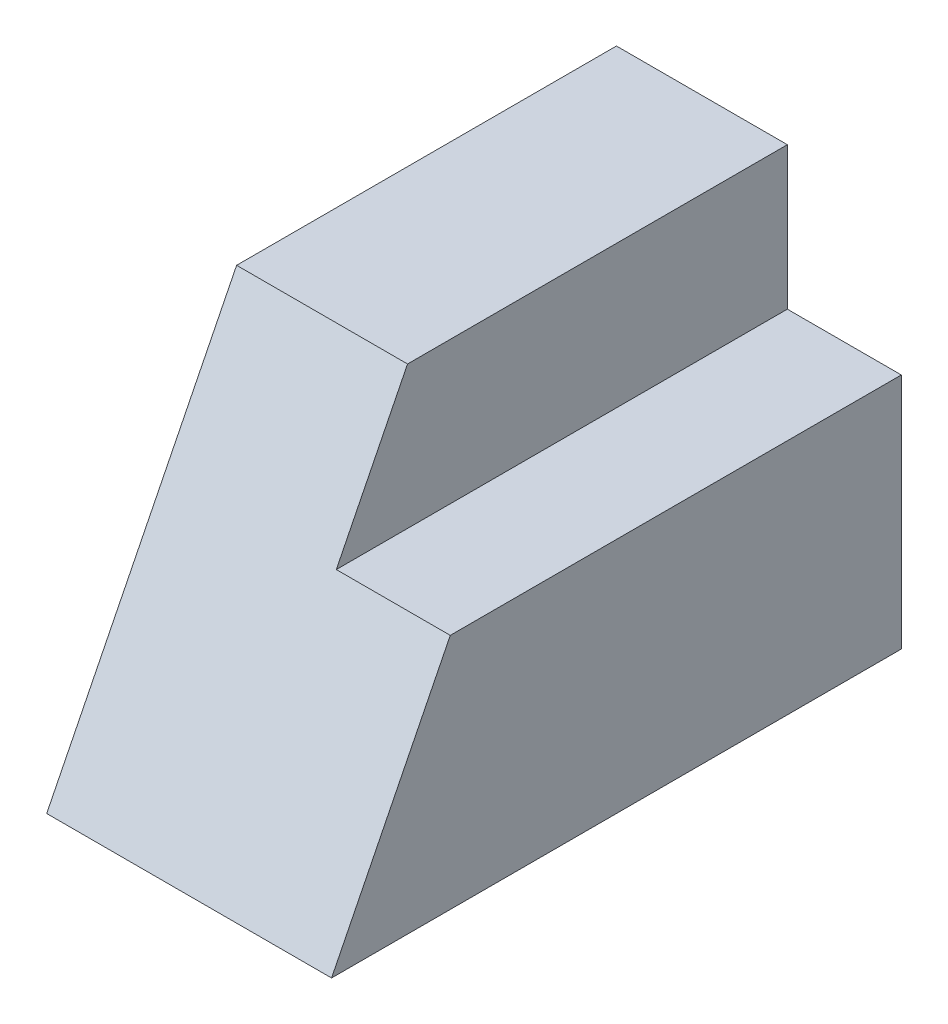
ISO-10303-21;
HEADER;
FILE_DESCRIPTION(('STEP AP214'),'2;1');
FILE_NAME('part.step','',(''),(''),'','','');
FILE_SCHEMA(('AUTOMOTIVE_DESIGN { 1 0 10303 214 1 1 1 1 }'));
ENDSEC;
DATA;
#1=APPLICATION_CONTEXT('core data for automotive mechanical design processes');
#2=APPLICATION_PROTOCOL_DEFINITION('international standard','automotive_design',2000,#1);
#3=PRODUCT_CONTEXT('',#1,'mechanical');
#4=PRODUCT('Part','Part','',(#3));
#5=PRODUCT_RELATED_PRODUCT_CATEGORY('part','',(#4));
#6=PRODUCT_DEFINITION_FORMATION('','',#4);
#7=PRODUCT_DEFINITION_CONTEXT('part definition',#1,'design');
#8=PRODUCT_DEFINITION('design','',#6,#7);
#9=PRODUCT_DEFINITION_SHAPE('','',#8);
#10=(LENGTH_UNIT() NAMED_UNIT(*) SI_UNIT(.MILLI.,.METRE.));
#11=(NAMED_UNIT(*) PLANE_ANGLE_UNIT() SI_UNIT($,.RADIAN.));
#12=(NAMED_UNIT(*) SI_UNIT($,.STERADIAN.) SOLID_ANGLE_UNIT());
#13=UNCERTAINTY_MEASURE_WITH_UNIT(LENGTH_MEASURE(1.E-05),#10,'distance_accuracy_value','');
#14=(GEOMETRIC_REPRESENTATION_CONTEXT(3) GLOBAL_UNCERTAINTY_ASSIGNED_CONTEXT((#13)) GLOBAL_UNIT_ASSIGNED_CONTEXT((#10,
#11,#12)) REPRESENTATION_CONTEXT('',''));
#15=CARTESIAN_POINT('',(0.,0.,0.));
#16=DIRECTION('',(0.,0.,1.));
#17=DIRECTION('',(1.,0.,0.));
#18=AXIS2_PLACEMENT_3D('',#15,#16,#17);
#19=CARTESIAN_POINT('',(15.,40.,30.));
#20=DIRECTION('',(-1.,0.,0.));
#21=DIRECTION('',(0.,0.,1.));
#22=AXIS2_PLACEMENT_3D('',#19,#20,#21);
#23=PLANE('',#22);
#24=DIRECTION('',(0.,-1.,0.));
#25=VECTOR('',#24,1.);
#26=CARTESIAN_POINT('',(15.,40.,-30.));
#27=LINE('',#26,#25);
#28=CARTESIAN_POINT('',(15.,25.,-30.));
#29=VERTEX_POINT('',#28);
#30=CARTESIAN_POINT('',(15.,0.,-30.));
#31=VERTEX_POINT('',#30);
#32=EDGE_CURVE('E75',#29,#31,#27,.T.);
#33=ORIENTED_EDGE('',*,*,#32,.F.);
#34=DIRECTION('',(0.,0.,-1.));
#35=VECTOR('',#34,1.);
#36=CARTESIAN_POINT('',(15.,25.,20.));
#37=LINE('',#36,#35);
#38=CARTESIAN_POINT('',(15.,25.,17.5));
#39=VERTEX_POINT('',#38);
#40=EDGE_CURVE('E111',#39,#29,#37,.T.);
#41=ORIENTED_EDGE('',*,*,#40,.F.);
#42=DIRECTION('',(0.,0.894427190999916,-0.447213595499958));
#43=VECTOR('',#42,1.);
#44=CARTESIAN_POINT('',(15.,0.,30.));
#45=LINE('',#44,#43);
#46=CARTESIAN_POINT('',(15.,0.,30.));
#47=VERTEX_POINT('',#46);
#48=EDGE_CURVE('E106',#47,#39,#45,.T.);
#49=ORIENTED_EDGE('',*,*,#48,.F.);
#50=DIRECTION('',(0.,0.,-1.));
#51=VECTOR('',#50,1.);
#52=CARTESIAN_POINT('',(15.,0.,30.));
#53=LINE('',#52,#51);
#54=EDGE_CURVE('E81',#47,#31,#53,.T.);
#55=ORIENTED_EDGE('',*,*,#54,.T.);
#56=EDGE_LOOP('',(#33,#41,#49,#55));
#57=FACE_BOUND('',#56,.T.);
#58=ADVANCED_FACE('F31',(#57),#23,.F.);
#59=CARTESIAN_POINT('',(-15.,40.,-30.));
#60=DIRECTION('',(0.,0.,1.));
#61=DIRECTION('',(1.,0.,0.));
#62=AXIS2_PLACEMENT_3D('',#59,#60,#61);
#63=PLANE('',#62);
#64=DIRECTION('',(-1.,0.,0.));
#65=VECTOR('',#64,1.);
#66=CARTESIAN_POINT('',(-15.,40.,-30.));
#67=LINE('',#66,#65);
#68=CARTESIAN_POINT('',(3.,40.,-30.));
#69=VERTEX_POINT('',#68);
#70=CARTESIAN_POINT('',(-15.,40.,-30.));
#71=VERTEX_POINT('',#70);
#72=EDGE_CURVE('E54',#69,#71,#67,.T.);
#73=ORIENTED_EDGE('',*,*,#72,.F.);
#74=DIRECTION('',(0.,1.,0.));
#75=VECTOR('',#74,1.);
#76=CARTESIAN_POINT('',(3.,25.,-30.));
#77=LINE('',#76,#75);
#78=CARTESIAN_POINT('',(3.,25.,-30.));
#79=VERTEX_POINT('',#78);
#80=EDGE_CURVE('E116',#79,#69,#77,.T.);
#81=ORIENTED_EDGE('',*,*,#80,.F.);
#82=DIRECTION('',(-1.,0.,0.));
#83=VECTOR('',#82,1.);
#84=CARTESIAN_POINT('',(15.,25.,-30.));
#85=LINE('',#84,#83);
#86=EDGE_CURVE('E121',#29,#79,#85,.T.);
#87=ORIENTED_EDGE('',*,*,#86,.F.);
#88=ORIENTED_EDGE('',*,*,#32,.T.);
#89=DIRECTION('',(-1.,0.,0.));
#90=VECTOR('',#89,1.);
#91=CARTESIAN_POINT('',(-15.,0.,-30.));
#92=LINE('',#91,#90);
#93=CARTESIAN_POINT('',(-15.,0.,-30.));
#94=VERTEX_POINT('',#93);
#95=EDGE_CURVE('E68',#31,#94,#92,.T.);
#96=ORIENTED_EDGE('',*,*,#95,.T.);
#97=DIRECTION('',(0.,-1.,0.));
#98=VECTOR('',#97,1.);
#99=CARTESIAN_POINT('',(-15.,40.,-30.));
#100=LINE('',#99,#98);
#101=EDGE_CURVE('E71',#71,#94,#100,.T.);
#102=ORIENTED_EDGE('',*,*,#101,.F.);
#103=EDGE_LOOP('',(#73,#81,#87,#88,#96,#102));
#104=FACE_BOUND('',#103,.T.);
#105=ADVANCED_FACE('F70',(#104),#63,.F.);
#106=CARTESIAN_POINT('',(-15.,40.,30.));
#107=DIRECTION('',(1.,0.,0.));
#108=DIRECTION('',(0.,0.,-1.));
#109=AXIS2_PLACEMENT_3D('',#106,#107,#108);
#110=PLANE('',#109);
#111=DIRECTION('',(0.,0.,1.));
#112=VECTOR('',#111,1.);
#113=CARTESIAN_POINT('',(-15.,0.,30.));
#114=LINE('',#113,#112);
#115=CARTESIAN_POINT('',(-15.,0.,30.));
#116=VERTEX_POINT('',#115);
#117=EDGE_CURVE('E80',#94,#116,#114,.T.);
#118=ORIENTED_EDGE('',*,*,#117,.T.);
#119=DIRECTION('',(0.,0.894427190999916,-0.447213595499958));
#120=VECTOR('',#119,1.);
#121=CARTESIAN_POINT('',(-15.,32.,14.));
#122=LINE('',#121,#120);
#123=CARTESIAN_POINT('',(-15.,40.,10.));
#124=VERTEX_POINT('',#123);
#125=EDGE_CURVE('E128',#116,#124,#122,.T.);
#126=ORIENTED_EDGE('',*,*,#125,.T.);
#127=DIRECTION('',(0.,0.,1.));
#128=VECTOR('',#127,1.);
#129=CARTESIAN_POINT('',(-15.,40.,30.));
#130=LINE('',#129,#128);
#131=EDGE_CURVE('E88',#71,#124,#130,.T.);
#132=ORIENTED_EDGE('',*,*,#131,.F.);
#133=ORIENTED_EDGE('',*,*,#101,.T.);
#134=EDGE_LOOP('',(#118,#126,#132,#133));
#135=FACE_BOUND('',#134,.T.);
#136=ADVANCED_FACE('F85',(#135),#110,.F.);
#137=CARTESIAN_POINT('',(15.,40.,-30.));
#138=DIRECTION('',(0.,-1.,0.));
#139=DIRECTION('',(0.,0.,-1.));
#140=AXIS2_PLACEMENT_3D('',#137,#138,#139);
#141=PLANE('',#140);
#142=DIRECTION('',(1.,0.,0.));
#143=VECTOR('',#142,1.);
#144=CARTESIAN_POINT('',(-35.,40.,10.));
#145=LINE('',#144,#143);
#146=CARTESIAN_POINT('',(3.,40.,9.99999999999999));
#147=VERTEX_POINT('',#146);
#148=EDGE_CURVE('E126',#124,#147,#145,.T.);
#149=ORIENTED_EDGE('',*,*,#148,.T.);
#150=DIRECTION('',(0.,0.,-1.));
#151=VECTOR('',#150,1.);
#152=CARTESIAN_POINT('',(3.,40.,20.));
#153=LINE('',#152,#151);
#154=EDGE_CURVE('E118',#147,#69,#153,.T.);
#155=ORIENTED_EDGE('',*,*,#154,.T.);
#156=ORIENTED_EDGE('',*,*,#72,.T.);
#157=ORIENTED_EDGE('',*,*,#131,.T.);
#158=EDGE_LOOP('',(#149,#155,#156,#157));
#159=FACE_BOUND('',#158,.T.);
#160=ADVANCED_FACE('F141',(#159),#141,.F.);
#161=CARTESIAN_POINT('',(15.,0.,-30.));
#162=DIRECTION('',(0.,-1.,0.));
#163=DIRECTION('',(0.,0.,-1.));
#164=AXIS2_PLACEMENT_3D('',#161,#162,#163);
#165=PLANE('',#164);
#166=ORIENTED_EDGE('',*,*,#54,.F.);
#167=DIRECTION('',(1.,0.,0.));
#168=VECTOR('',#167,1.);
#169=CARTESIAN_POINT('',(-15.,0.,30.));
#170=LINE('',#169,#168);
#171=EDGE_CURVE('E92',#116,#47,#170,.T.);
#172=ORIENTED_EDGE('',*,*,#171,.F.);
#173=ORIENTED_EDGE('',*,*,#117,.F.);
#174=ORIENTED_EDGE('',*,*,#95,.F.);
#175=EDGE_LOOP('',(#166,#172,#173,#174));
#176=FACE_BOUND('',#175,.T.);
#177=ADVANCED_FACE('F90',(#176),#165,.T.);
#178=CARTESIAN_POINT('',(-35.,0.,30.));
#179=DIRECTION('',(0.,-0.447213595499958,-0.894427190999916));
#180=DIRECTION('',(0.,0.894427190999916,-0.447213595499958));
#181=AXIS2_PLACEMENT_3D('',#178,#179,#180);
#182=PLANE('',#181);
#183=DIRECTION('',(-1.,0.,0.));
#184=VECTOR('',#183,1.);
#185=CARTESIAN_POINT('',(-35.,25.,17.5));
#186=LINE('',#185,#184);
#187=CARTESIAN_POINT('',(3.,25.,17.5));
#188=VERTEX_POINT('',#187);
#189=EDGE_CURVE('E38',#39,#188,#186,.T.);
#190=ORIENTED_EDGE('',*,*,#189,.T.);
#191=DIRECTION('',(0.,0.894427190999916,-0.447213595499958));
#192=VECTOR('',#191,1.);
#193=CARTESIAN_POINT('',(3.,0.,30.));
#194=LINE('',#193,#192);
#195=EDGE_CURVE('E11',#188,#147,#194,.T.);
#196=ORIENTED_EDGE('',*,*,#195,.T.);
#197=ORIENTED_EDGE('',*,*,#148,.F.);
#198=ORIENTED_EDGE('',*,*,#125,.F.);
#199=ORIENTED_EDGE('',*,*,#171,.T.);
#200=ORIENTED_EDGE('',*,*,#48,.T.);
#201=EDGE_LOOP('',(#190,#196,#197,#198,#199,#200));
#202=FACE_BOUND('',#201,.T.);
#203=ADVANCED_FACE('F100',(#202),#182,.F.);
#204=CARTESIAN_POINT('',(3.,25.,20.));
#205=DIRECTION('',(-1.,0.,0.));
#206=DIRECTION('',(0.,0.,1.));
#207=AXIS2_PLACEMENT_3D('',#204,#205,#206);
#208=PLANE('',#207);
#209=DIRECTION('',(0.,0.,-1.));
#210=VECTOR('',#209,1.);
#211=CARTESIAN_POINT('',(3.,25.,20.));
#212=LINE('',#211,#210);
#213=EDGE_CURVE('E45',#188,#79,#212,.T.);
#214=ORIENTED_EDGE('',*,*,#213,.T.);
#215=ORIENTED_EDGE('',*,*,#80,.T.);
#216=ORIENTED_EDGE('',*,*,#154,.F.);
#217=ORIENTED_EDGE('',*,*,#195,.F.);
#218=EDGE_LOOP('',(#214,#215,#216,#217));
#219=FACE_BOUND('',#218,.T.);
#220=ADVANCED_FACE('F138',(#219),#208,.F.);
#221=CARTESIAN_POINT('',(15.,25.,20.));
#222=DIRECTION('',(0.,-1.,0.));
#223=DIRECTION('',(0.,0.,-1.));
#224=AXIS2_PLACEMENT_3D('',#221,#222,#223);
#225=PLANE('',#224);
#226=ORIENTED_EDGE('',*,*,#40,.T.);
#227=ORIENTED_EDGE('',*,*,#86,.T.);
#228=ORIENTED_EDGE('',*,*,#213,.F.);
#229=ORIENTED_EDGE('',*,*,#189,.F.);
#230=EDGE_LOOP('',(#226,#227,#228,#229));
#231=FACE_BOUND('',#230,.T.);
#232=ADVANCED_FACE('F109',(#231),#225,.F.);
#233=CLOSED_SHELL('',(#58,#105,#136,#160,#177,#203,#220,#232));
#234=MANIFOLD_SOLID_BREP('B2',#233);
#235=ADVANCED_BREP_SHAPE_REPRESENTATION('',(#18,#234),#14);
#236=SHAPE_DEFINITION_REPRESENTATION(#9,#235);
ENDSEC;
END-ISO-10303-21;
